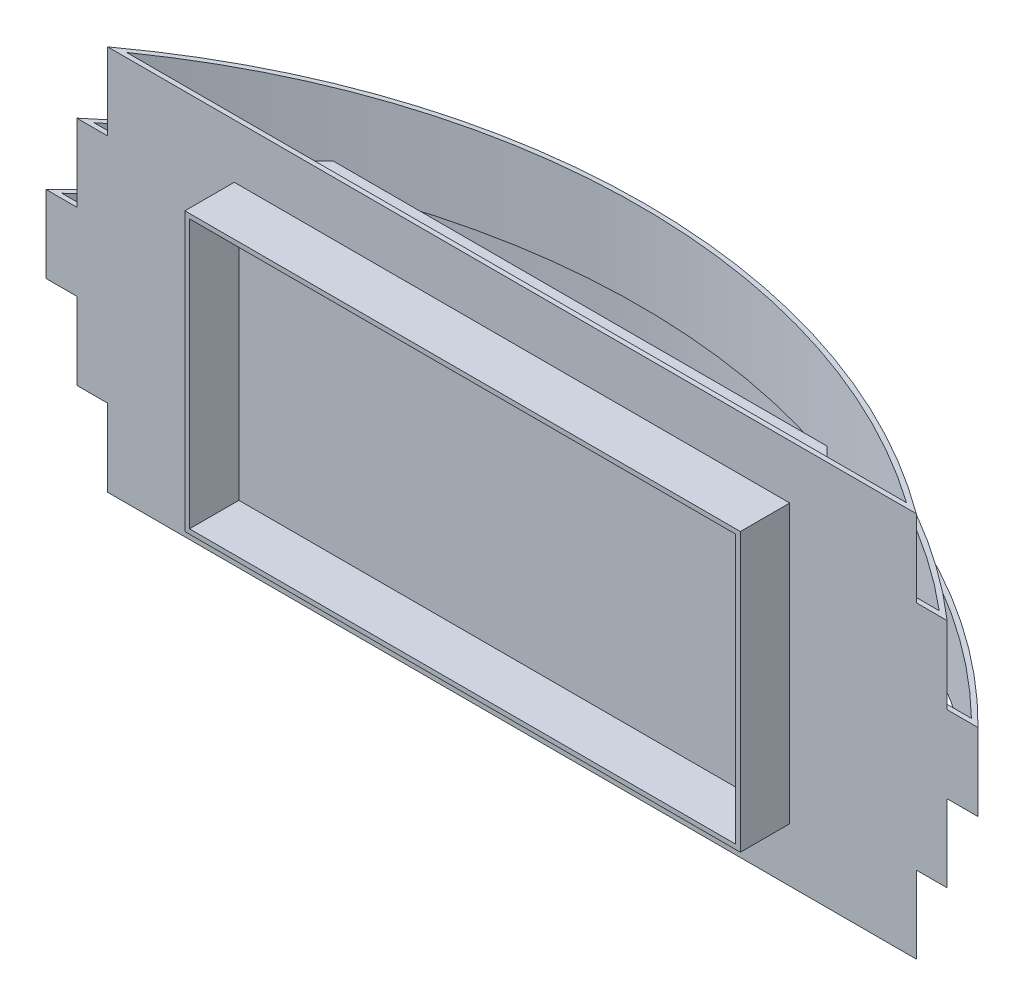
from build123d import *

# Parameters (mm, degrees)
SALIENTE_EXTRUIR1_DEPTH      = 12.5
SALIENTE_EXTRUIR1_DEPTH_BACK = 12.5
SALIENTE_EXTRUIR2_DEPTH      = 28
SALIENTE_EXTRUIR3_DEPTH      = 28
CROQUIS5_W                   = 180
CROQUIS5_H                   = 90
CROQUIS5_W_2                 = 177
CROQUIS5_H_2                 = 87
SALIENTE_EXTRUIR4_DEPTH      = 16
CROQUIS7_W                   = 180
CROQUIS7_H                   = 90
SALIENTE_EXTRUIR5_DEPTH      = 22
CHAFL_N2_SIZE                = 10


with BuildPart() as part:
    # Croquis1 → Saliente-Extruir1 (new, two sides: drawn at the far end of the back side and taken through both)
    with BuildSketch(Plane(origin=(0, 0, 0), x_dir=(1, 0, 0), z_dir=(0, 1, 0)).offset(-SALIENTE_EXTRUIR1_DEPTH_BACK)):
        with BuildLine():
            Line((-151, 0), (151, 0))
            ThreePointArc((151, 0), (0, 63.108893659), (-151, 0))
        make_face()
        with BuildLine():
            Line((-147.367267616, 1.5), (147.367267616, 1.5))
            ThreePointArc((147.367267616, 1.5), (0, 61.608893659), (-147.367267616, 1.5))
        make_face(mode=Mode.SUBTRACT)
    extrude(amount=SALIENTE_EXTRUIR1_DEPTH + SALIENTE_EXTRUIR1_DEPTH_BACK)

    # Croquis2 → Saliente-Extruir2 (add)
    with BuildSketch(Plane(origin=(0, 9.5, 0), x_dir=(1, 0, 0), z_dir=(0, 1, 0))):
        with BuildLine():
            Line((-141, 0), (141, 0))
            ThreePointArc((141, 0), (0, 53.004910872), (-141, 0))
        make_face()
        with BuildLine():
            Line((-136.951687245, 1.5), (136.951687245, 1.5))
            ThreePointArc((136.951687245, 1.5), (0, 51.504910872), (-136.951687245, 1.5))
        make_face(mode=Mode.SUBTRACT)
    saliente_extruir2 = extrude(amount=SALIENTE_EXTRUIR2_DEPTH)

    # Croquis3 → Saliente-Extruir3 (add)
    with BuildSketch(Plane(origin=(0, 34.5, 0), x_dir=(1, 0, 0), z_dir=(0, 1, 0))):
        with BuildLine():
            Line((-131, 0), (131, 0))
            ThreePointArc((131, 0), (0, 43.040520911), (-131, 0))
        make_face()
        with BuildLine():
            Line((-126.352079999, 1.5), (126.352079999, 1.5))
            ThreePointArc((126.352079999, 1.5), (0, 41.540520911), (-126.352079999, 1.5))
        make_face(mode=Mode.SUBTRACT)
    saliente_extruir3 = extrude(amount=SALIENTE_EXTRUIR3_DEPTH)

    # Simetr_a1: Saliente-Extruir2, Saliente-Extruir3 across plane
    add(saliente_extruir2.mirror(Plane.ZX))
    add(saliente_extruir3.mirror(Plane.ZX))

    # Croquis5 → Saliente-Extruir4 (add)
    with BuildSketch(Plane.XY):
        Rectangle(CROQUIS5_W, CROQUIS5_H)
        Rectangle(CROQUIS5_W_2, CROQUIS5_H_2, mode=Mode.SUBTRACT)
    extrude(amount=SALIENTE_EXTRUIR4_DEPTH)

    # Croquis7 → Saliente-Extruir5 (add)
    with BuildSketch(Plane.XY):
        Rectangle(CROQUIS7_W, CROQUIS7_H)
    extrude(amount=-SALIENTE_EXTRUIR5_DEPTH)

    # Chafl_n2
    chafl_n2_edges = [part.edges().sort_by_distance(p)[0] for p in [
        (-90, 0, -22),
        (90, 0, -22),
    ]]
    chamfer(chafl_n2_edges, length=CHAFL_N2_SIZE)


solid = part.part
